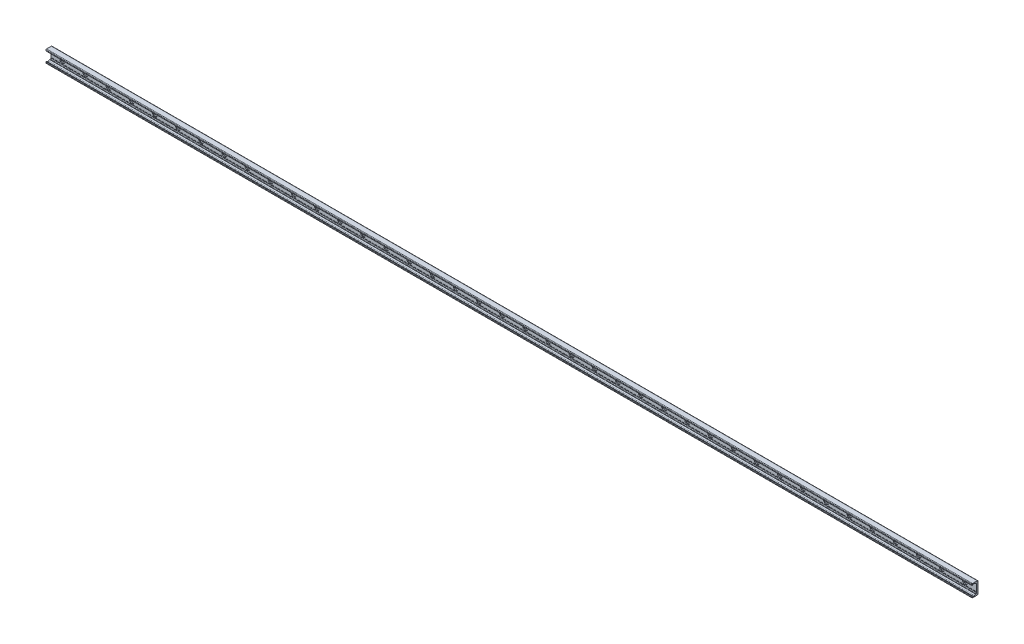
from build123d import *

# Parameters (mm, degrees)
BOSS_EXTRUDE1_DEPTH = 1600
SKETCH2_R           = 9
SKETCH2_R_2         = 4.5
CUT_EXTRUDE1_DEPTH  = 3.1
SKETCH2_2_R         = 4.5
CUT_EXTRUDE2_DEPTH  = 1601.229514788
LPATTERN1_COUNT     = 40
LPATTERN1_PITCH     = 80


with BuildPart() as part:
    # Sketch1 → Boss-Extrude1 (new, symmetric)
    with BuildSketch(Plane(origin=(0, 0, 0), x_dir=(0, 0, -1), z_dir=(1, 0, 0))):
        with BuildLine():
            Line((0, 0), (0, 19))
            ThreePointArc((0, 19), (-0.732233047, 20.767766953), (-2.5, 21.5))
            Line((-2.5, 21.5), (-19, 21.5))
            ThreePointArc((-19, 21.5), (-20.414213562, 20.914213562), (-21, 19.5))
            Line((-21, 19.5), (-21, 16.625057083))
            ThreePointArc((-21, 16.625057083), (-20.553251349, 15.888838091), (-19.693931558, 15.945160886))
            Line((-19.693931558, 15.945160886), (-16.794305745, 17.975500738))
            ThreePointArc((-16.794305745, 17.975500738), (-14.5, 18.69889256), (-12.205694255, 17.975500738))
            Line((-12.205694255, 17.975500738), (-8.829831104, 15.611695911))
            ThreePointArc((-8.829831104, 15.611695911), (-8.28408983, 15.342566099), (-7.682678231, 15.25))
            Line((-7.682678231, 15.25), (-6.5, 15.25))
            ThreePointArc((-6.5, 15.25), (-5.085786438, 14.664213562), (-4.5, 13.25))
            Line((-4.5, 13.25), (-4.5, -10.75))
            ThreePointArc((-4.5, -10.75), (-4.25, -11), (-4.5, -11.25))
            Line((-4.5, -11.25), (-4.5, -12.25))
            ThreePointArc((-4.5, -12.25), (-4.25, -12.5), (-4.5, -12.75))
            Line((-4.5, -12.75), (-4.5, -13.25))
            ThreePointArc((-4.5, -13.25), (-5.085786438, -14.664213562), (-6.5, -15.25))
            Line((-6.5, -15.25), (-7.682678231, -15.25))
            ThreePointArc((-7.682678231, -15.25), (-8.28408983, -15.342566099), (-8.829831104, -15.611695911))
            Line((-8.829831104, -15.611695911), (-12.205694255, -17.975500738))
            ThreePointArc((-12.205694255, -17.975500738), (-14.5, -18.69889256), (-16.794305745, -17.975500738))
            Line((-16.794305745, -17.975500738), (-19.693931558, -15.945160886))
            ThreePointArc((-19.693931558, -15.945160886), (-20.553251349, -15.888838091), (-21, -16.625057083))
            Line((-21, -16.625057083), (-21, -19.5))
            ThreePointArc((-21, -19.5), (-20.414213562, -20.914213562), (-19, -21.5))
            Line((-19, -21.5), (-2.5, -21.5))
            ThreePointArc((-2.5, -21.5), (-0.732233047, -20.767766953), (0, -19))
            Line((0, -19), (0, 0))
        make_face()
    extrude(amount=BOSS_EXTRUDE1_DEPTH, both=True)

    # Sketch2 → Cut-Extrude1 (cut)
    with BuildSketch(Plane.XY.offset(4.5)):
        with Locations((1560, 0)):
            Circle(SKETCH2_R)
        with Locations((1560, 0)):
            Circle(SKETCH2_R_2, mode=Mode.SUBTRACT)
    cut_extrude1 = extrude(amount=-CUT_EXTRUDE1_DEPTH, mode=Mode.SUBTRACT)

    # Sketch2_2 → Cut-Extrude2 (cut, through all)
    with BuildSketch(Plane.XY.offset(4.5)):
        with Locations((1560, 0)):
            Circle(SKETCH2_2_R)
    cut_extrude2 = extrude(amount=-CUT_EXTRUDE2_DEPTH, mode=Mode.SUBTRACT)

    # LPattern1: Cut-Extrude1, Cut-Extrude2 ×40
    with Locations(*[(-i * LPATTERN1_PITCH, 0, 0) for i in range(1, LPATTERN1_COUNT)]):
        add(cut_extrude1, mode=Mode.SUBTRACT)
        add(cut_extrude2, mode=Mode.SUBTRACT)


solid = part.part
